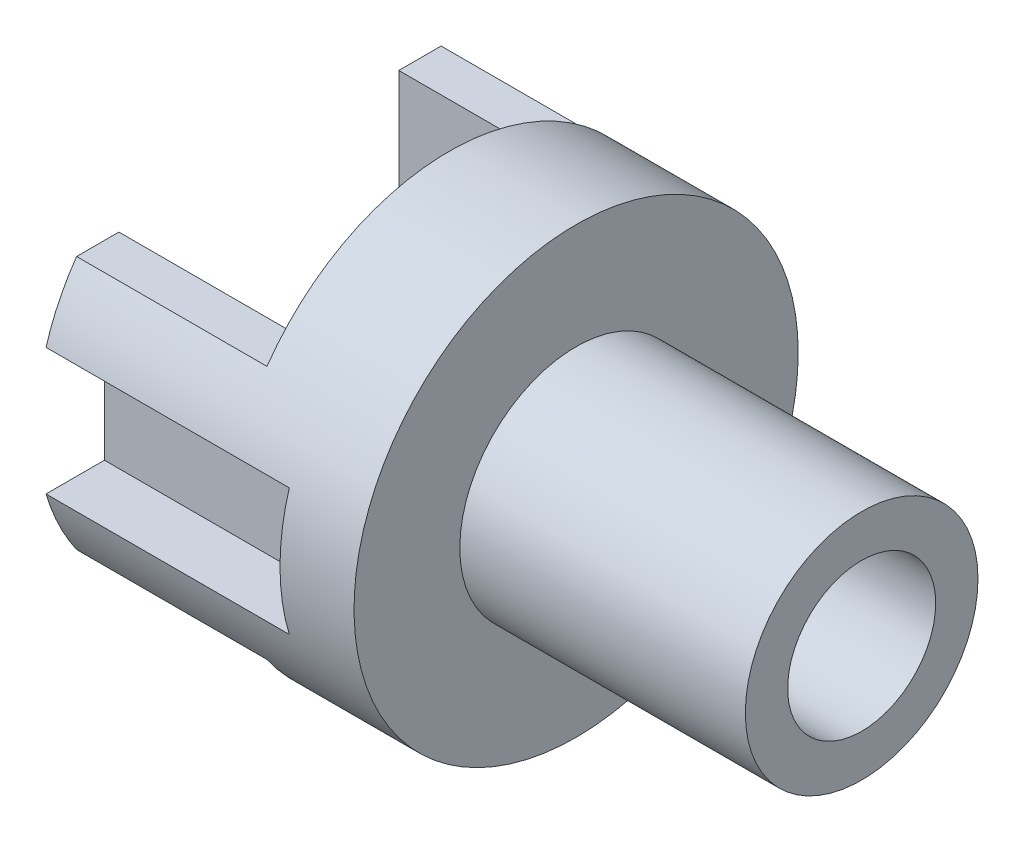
ISO-10303-21;
HEADER;
FILE_DESCRIPTION(('STEP AP214'),'2;1');
FILE_NAME('part.step','',(''),(''),'','','');
FILE_SCHEMA(('AUTOMOTIVE_DESIGN { 1 0 10303 214 1 1 1 1 }'));
ENDSEC;
DATA;
#1=APPLICATION_CONTEXT('core data for automotive mechanical design processes');
#2=APPLICATION_PROTOCOL_DEFINITION('international standard','automotive_design',2000,#1);
#3=PRODUCT_CONTEXT('',#1,'mechanical');
#4=PRODUCT('Part','Part','',(#3));
#5=PRODUCT_RELATED_PRODUCT_CATEGORY('part','',(#4));
#6=PRODUCT_DEFINITION_FORMATION('','',#4);
#7=PRODUCT_DEFINITION_CONTEXT('part definition',#1,'design');
#8=PRODUCT_DEFINITION('design','',#6,#7);
#9=PRODUCT_DEFINITION_SHAPE('','',#8);
#10=(LENGTH_UNIT() NAMED_UNIT(*) SI_UNIT(.MILLI.,.METRE.));
#11=(NAMED_UNIT(*) PLANE_ANGLE_UNIT() SI_UNIT($,.RADIAN.));
#12=(NAMED_UNIT(*) SI_UNIT($,.STERADIAN.) SOLID_ANGLE_UNIT());
#13=UNCERTAINTY_MEASURE_WITH_UNIT(LENGTH_MEASURE(1.E-05),#10,'distance_accuracy_value','');
#14=(GEOMETRIC_REPRESENTATION_CONTEXT(3) GLOBAL_UNCERTAINTY_ASSIGNED_CONTEXT((#13)) GLOBAL_UNIT_ASSIGNED_CONTEXT((#10,
#11,#12)) REPRESENTATION_CONTEXT('',''));
#15=CARTESIAN_POINT('',(0.,0.,0.));
#16=DIRECTION('',(0.,0.,1.));
#17=DIRECTION('',(1.,0.,0.));
#18=AXIS2_PLACEMENT_3D('',#15,#16,#17);
#19=CARTESIAN_POINT('',(120.,0.,0.));
#20=DIRECTION('',(1.,0.,0.));
#21=DIRECTION('',(0.,0.,-1.));
#22=AXIS2_PLACEMENT_3D('',#19,#20,#21);
#23=PLANE('',#22);
#24=CARTESIAN_POINT('',(120.,0.,0.));
#25=DIRECTION('',(1.,0.,0.));
#26=DIRECTION('',(0.,0.,-1.));
#27=AXIS2_PLACEMENT_3D('',#24,#25,#26);
#28=CIRCLE('',#27,84.);
#29=CARTESIAN_POINT('',(120.,0.,-84.));
#30=VERTEX_POINT('',#29);
#31=EDGE_CURVE('E11',#30,#30,#28,.T.);
#32=ORIENTED_EDGE('',*,*,#31,.T.);
#33=EDGE_LOOP('',(#32));
#34=FACE_BOUND('',#33,.T.);
#35=CARTESIAN_POINT('',(120.,0.,0.));
#36=DIRECTION('',(1.,0.,0.));
#37=DIRECTION('',(0.,0.,-1.));
#38=AXIS2_PLACEMENT_3D('',#35,#36,#37);
#39=CIRCLE('',#38,44.);
#40=CARTESIAN_POINT('',(120.,0.,-44.));
#41=VERTEX_POINT('',#40);
#42=EDGE_CURVE('E171',#41,#41,#39,.T.);
#43=ORIENTED_EDGE('',*,*,#42,.F.);
#44=EDGE_LOOP('',(#43));
#45=FACE_BOUND('',#44,.T.);
#46=ADVANCED_FACE('F31',(#34,#45),#23,.T.);
#47=CARTESIAN_POINT('',(120.,0.,0.));
#48=DIRECTION('',(-1.,0.,0.));
#49=DIRECTION('',(0.,0.,1.));
#50=AXIS2_PLACEMENT_3D('',#47,#48,#49);
#51=CYLINDRICAL_SURFACE('',#50,84.);
#52=CARTESIAN_POINT('',(0.,0.,0.));
#53=DIRECTION('',(1.,0.,0.));
#54=DIRECTION('',(0.,0.,-1.));
#55=AXIS2_PLACEMENT_3D('',#52,#53,#54);
#56=CIRCLE('',#55,84.);
#57=CARTESIAN_POINT('',(0.,48.,68.9347517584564));
#58=VERTEX_POINT('',#57);
#59=CARTESIAN_POINT('',(0.,24.,80.4984471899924));
#60=VERTEX_POINT('',#59);
#61=EDGE_CURVE('E40',#58,#60,#56,.T.);
#62=ORIENTED_EDGE('',*,*,#61,.T.);
#63=DIRECTION('',(-1.,0.,0.));
#64=VECTOR('',#63,1.);
#65=CARTESIAN_POINT('',(92.,24.,80.4984471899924));
#66=LINE('',#65,#64);
#67=CARTESIAN_POINT('',(92.,24.,80.4984471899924));
#68=VERTEX_POINT('',#67);
#69=EDGE_CURVE('E181',#68,#60,#66,.T.);
#70=ORIENTED_EDGE('',*,*,#69,.F.);
#71=CARTESIAN_POINT('',(92.,0.,0.));
#72=DIRECTION('',(-1.,0.,0.));
#73=DIRECTION('',(0.,0.,1.));
#74=AXIS2_PLACEMENT_3D('',#71,#72,#73);
#75=CIRCLE('',#74,84.);
#76=CARTESIAN_POINT('',(92.,-24.,80.4984471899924));
#77=VERTEX_POINT('',#76);
#78=EDGE_CURVE('E161',#68,#77,#75,.F.);
#79=ORIENTED_EDGE('',*,*,#78,.T.);
#80=DIRECTION('',(-1.,0.,0.));
#81=VECTOR('',#80,1.);
#82=CARTESIAN_POINT('',(92.,-24.,80.4984471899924));
#83=LINE('',#82,#81);
#84=CARTESIAN_POINT('',(0.,-24.,80.4984471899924));
#85=VERTEX_POINT('',#84);
#86=EDGE_CURVE('E152',#77,#85,#83,.T.);
#87=ORIENTED_EDGE('',*,*,#86,.T.);
#88=CARTESIAN_POINT('',(0.,-48.,68.9347517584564));
#89=VERTEX_POINT('',#88);
#90=EDGE_CURVE('E288',#85,#89,#56,.T.);
#91=ORIENTED_EDGE('',*,*,#90,.T.);
#92=DIRECTION('',(-1.,0.,0.));
#93=VECTOR('',#92,1.);
#94=CARTESIAN_POINT('',(72.,-48.,68.9347517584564));
#95=LINE('',#94,#93);
#96=CARTESIAN_POINT('',(72.,-48.,68.9347517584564));
#97=VERTEX_POINT('',#96);
#98=EDGE_CURVE('E247',#97,#89,#95,.T.);
#99=ORIENTED_EDGE('',*,*,#98,.F.);
#100=CARTESIAN_POINT('',(72.,0.,0.));
#101=DIRECTION('',(-1.,0.,0.));
#102=DIRECTION('',(0.,0.,1.));
#103=AXIS2_PLACEMENT_3D('',#100,#101,#102);
#104=CIRCLE('',#103,84.);
#105=CARTESIAN_POINT('',(72.,-48.,-68.9347517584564));
#106=VERTEX_POINT('',#105);
#107=EDGE_CURVE('E223',#97,#106,#104,.F.);
#108=ORIENTED_EDGE('',*,*,#107,.T.);
#109=DIRECTION('',(-1.,0.,0.));
#110=VECTOR('',#109,1.);
#111=CARTESIAN_POINT('',(72.,-48.,-68.9347517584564));
#112=LINE('',#111,#110);
#113=CARTESIAN_POINT('',(0.,-48.,-68.9347517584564));
#114=VERTEX_POINT('',#113);
#115=EDGE_CURVE('E251',#106,#114,#112,.T.);
#116=ORIENTED_EDGE('',*,*,#115,.T.);
#117=CARTESIAN_POINT('',(0.,-24.,-80.4984471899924));
#118=VERTEX_POINT('',#117);
#119=EDGE_CURVE('E35',#114,#118,#56,.T.);
#120=ORIENTED_EDGE('',*,*,#119,.T.);
#121=DIRECTION('',(-1.,0.,0.));
#122=VECTOR('',#121,1.);
#123=CARTESIAN_POINT('',(92.,-24.,-80.4984471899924));
#124=LINE('',#123,#122);
#125=CARTESIAN_POINT('',(92.,-24.,-80.4984471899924));
#126=VERTEX_POINT('',#125);
#127=EDGE_CURVE('E202',#126,#118,#124,.T.);
#128=ORIENTED_EDGE('',*,*,#127,.F.);
#129=CARTESIAN_POINT('',(92.,0.,0.));
#130=DIRECTION('',(-1.,0.,0.));
#131=DIRECTION('',(0.,0.,1.));
#132=AXIS2_PLACEMENT_3D('',#129,#130,#131);
#133=CIRCLE('',#132,84.);
#134=CARTESIAN_POINT('',(92.,24.,-80.4984471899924));
#135=VERTEX_POINT('',#134);
#136=EDGE_CURVE('E192',#126,#135,#133,.F.);
#137=ORIENTED_EDGE('',*,*,#136,.T.);
#138=DIRECTION('',(-1.,0.,0.));
#139=VECTOR('',#138,1.);
#140=CARTESIAN_POINT('',(92.,24.,-80.4984471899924));
#141=LINE('',#140,#139);
#142=CARTESIAN_POINT('',(0.,24.,-80.4984471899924));
#143=VERTEX_POINT('',#142);
#144=EDGE_CURVE('E205',#135,#143,#141,.T.);
#145=ORIENTED_EDGE('',*,*,#144,.T.);
#146=CARTESIAN_POINT('',(0.,48.,-68.9347517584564));
#147=VERTEX_POINT('',#146);
#148=EDGE_CURVE('E250',#143,#147,#56,.T.);
#149=ORIENTED_EDGE('',*,*,#148,.T.);
#150=DIRECTION('',(-1.,0.,0.));
#151=VECTOR('',#150,1.);
#152=CARTESIAN_POINT('',(72.,48.,-68.9347517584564));
#153=LINE('',#152,#151);
#154=CARTESIAN_POINT('',(72.,48.,-68.9347517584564));
#155=VERTEX_POINT('',#154);
#156=EDGE_CURVE('E258',#155,#147,#153,.T.);
#157=ORIENTED_EDGE('',*,*,#156,.F.);
#158=CARTESIAN_POINT('',(72.,48.,68.9347517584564));
#159=VERTEX_POINT('',#158);
#160=EDGE_CURVE('E219',#155,#159,#104,.F.);
#161=ORIENTED_EDGE('',*,*,#160,.T.);
#162=DIRECTION('',(-1.,0.,0.));
#163=VECTOR('',#162,1.);
#164=CARTESIAN_POINT('',(72.,48.,68.9347517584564));
#165=LINE('',#164,#163);
#166=EDGE_CURVE('E261',#159,#58,#165,.T.);
#167=ORIENTED_EDGE('',*,*,#166,.T.);
#168=EDGE_LOOP('',(#62,#70,#79,#87,#91,#99,#108,#116,#120,#128,#137,#145,#149,#157,#161,#167));
#169=FACE_BOUND('',#168,.T.);
#170=ORIENTED_EDGE('',*,*,#31,.F.);
#171=EDGE_LOOP('',(#170));
#172=FACE_BOUND('',#171,.T.);
#173=ADVANCED_FACE('F33',(#169,#172),#51,.T.);
#174=CARTESIAN_POINT('',(0.,0.,0.));
#175=DIRECTION('',(1.,0.,0.));
#176=DIRECTION('',(0.,0.,-1.));
#177=AXIS2_PLACEMENT_3D('',#174,#175,#176);
#178=PLANE('',#177);
#179=DIRECTION('',(0.,0.,-1.));
#180=VECTOR('',#179,1.);
#181=CARTESIAN_POINT('',(0.,-24.,0.));
#182=LINE('',#181,#180);
#183=CARTESIAN_POINT('',(0.,-24.,-59.8449612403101));
#184=VERTEX_POINT('',#183);
#185=EDGE_CURVE('E55',#184,#118,#182,.T.);
#186=ORIENTED_EDGE('',*,*,#185,.T.);
#187=ORIENTED_EDGE('',*,*,#119,.F.);
#188=DIRECTION('',(0.,0.,-1.));
#189=VECTOR('',#188,1.);
#190=CARTESIAN_POINT('',(0.,-47.9999999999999,0.));
#191=LINE('',#190,#189);
#192=CARTESIAN_POINT('',(0.,-48.,-52.9347517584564));
#193=VERTEX_POINT('',#192);
#194=EDGE_CURVE('E215',#193,#114,#191,.T.);
#195=ORIENTED_EDGE('',*,*,#194,.F.);
#196=DIRECTION('',(0.,-1.,0.));
#197=VECTOR('',#196,1.);
#198=CARTESIAN_POINT('',(0.,-184.941421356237,-52.9347517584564));
#199=LINE('',#198,#197);
#200=CARTESIAN_POINT('',(0.,48.,-52.9347517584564));
#201=VERTEX_POINT('',#200);
#202=EDGE_CURVE('E243',#201,#193,#199,.T.);
#203=ORIENTED_EDGE('',*,*,#202,.F.);
#204=DIRECTION('',(0.,0.,1.));
#205=VECTOR('',#204,1.);
#206=CARTESIAN_POINT('',(0.,48.,0.));
#207=LINE('',#206,#205);
#208=EDGE_CURVE('E240',#147,#201,#207,.T.);
#209=ORIENTED_EDGE('',*,*,#208,.F.);
#210=ORIENTED_EDGE('',*,*,#148,.F.);
#211=DIRECTION('',(0.,0.,1.));
#212=VECTOR('',#211,1.);
#213=CARTESIAN_POINT('',(0.,24.,0.));
#214=LINE('',#213,#212);
#215=CARTESIAN_POINT('',(0.,24.,-59.8449612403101));
#216=VERTEX_POINT('',#215);
#217=EDGE_CURVE('E188',#143,#216,#214,.T.);
#218=ORIENTED_EDGE('',*,*,#217,.T.);
#219=DIRECTION('',(0.,-1.,0.));
#220=VECTOR('',#219,1.);
#221=CARTESIAN_POINT('',(0.,-184.941421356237,-59.8449612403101));
#222=LINE('',#221,#220);
#223=EDGE_CURVE('E197',#216,#184,#222,.T.);
#224=ORIENTED_EDGE('',*,*,#223,.T.);
#225=EDGE_LOOP('',(#186,#187,#195,#203,#209,#210,#218,#224));
#226=FACE_BOUND('',#225,.T.);
#227=ADVANCED_FACE('F302',(#226),#178,.F.);
#228=DIRECTION('',(0.,-1.,0.));
#229=VECTOR('',#228,1.);
#230=CARTESIAN_POINT('',(0.,-184.941421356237,58.4021825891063));
#231=LINE('',#230,#229);
#232=CARTESIAN_POINT('',(0.,24.,58.4021825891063));
#233=VERTEX_POINT('',#232);
#234=CARTESIAN_POINT('',(0.,-24.,58.4021825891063));
#235=VERTEX_POINT('',#234);
#236=EDGE_CURVE('E47',#233,#235,#231,.T.);
#237=ORIENTED_EDGE('',*,*,#236,.F.);
#238=DIRECTION('',(0.,0.,-1.));
#239=VECTOR('',#238,1.);
#240=CARTESIAN_POINT('',(0.,24.,0.));
#241=LINE('',#240,#239);
#242=EDGE_CURVE('E165',#60,#233,#241,.T.);
#243=ORIENTED_EDGE('',*,*,#242,.F.);
#244=ORIENTED_EDGE('',*,*,#61,.F.);
#245=DIRECTION('',(0.,0.,-1.));
#246=VECTOR('',#245,1.);
#247=CARTESIAN_POINT('',(0.,48.0000000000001,3.24203880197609E-13));
#248=LINE('',#247,#246);
#249=CARTESIAN_POINT('',(0.,48.,52.9347517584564));
#250=VERTEX_POINT('',#249);
#251=EDGE_CURVE('E237',#58,#250,#248,.T.);
#252=ORIENTED_EDGE('',*,*,#251,.T.);
#253=DIRECTION('',(0.,-1.,0.));
#254=VECTOR('',#253,1.);
#255=CARTESIAN_POINT('',(0.,-184.941421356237,52.9347517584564));
#256=LINE('',#255,#254);
#257=CARTESIAN_POINT('',(0.,-48.,52.9347517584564));
#258=VERTEX_POINT('',#257);
#259=EDGE_CURVE('E234',#250,#258,#256,.T.);
#260=ORIENTED_EDGE('',*,*,#259,.T.);
#261=DIRECTION('',(0.,0.,1.));
#262=VECTOR('',#261,1.);
#263=CARTESIAN_POINT('',(0.,-48.,0.));
#264=LINE('',#263,#262);
#265=EDGE_CURVE('E204',#258,#89,#264,.T.);
#266=ORIENTED_EDGE('',*,*,#265,.T.);
#267=ORIENTED_EDGE('',*,*,#90,.F.);
#268=DIRECTION('',(0.,0.,1.));
#269=VECTOR('',#268,1.);
#270=CARTESIAN_POINT('',(0.,-24.,0.));
#271=LINE('',#270,#269);
#272=EDGE_CURVE('E168',#235,#85,#271,.T.);
#273=ORIENTED_EDGE('',*,*,#272,.F.);
#274=EDGE_LOOP('',(#237,#243,#244,#252,#260,#266,#267,#273));
#275=FACE_BOUND('',#274,.T.);
#276=ADVANCED_FACE('F287',(#275),#178,.F.);
#277=CARTESIAN_POINT('',(72.,-48.,0.));
#278=DIRECTION('',(0.,-1.,0.));
#279=DIRECTION('',(0.,0.,-1.));
#280=AXIS2_PLACEMENT_3D('',#277,#278,#279);
#281=PLANE('',#280);
#282=ORIENTED_EDGE('',*,*,#265,.F.);
#283=DIRECTION('',(-1.,0.,0.));
#284=VECTOR('',#283,1.);
#285=CARTESIAN_POINT('',(72.,-48.,52.9347517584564));
#286=LINE('',#285,#284);
#287=CARTESIAN_POINT('',(72.,-48.,52.9347517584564));
#288=VERTEX_POINT('',#287);
#289=EDGE_CURVE('E266',#288,#258,#286,.T.);
#290=ORIENTED_EDGE('',*,*,#289,.F.);
#291=DIRECTION('',(0.,0.,1.));
#292=VECTOR('',#291,1.);
#293=CARTESIAN_POINT('',(72.,-48.,0.));
#294=LINE('',#293,#292);
#295=EDGE_CURVE('E211',#288,#97,#294,.T.);
#296=ORIENTED_EDGE('',*,*,#295,.T.);
#297=ORIENTED_EDGE('',*,*,#98,.T.);
#298=EDGE_LOOP('',(#282,#290,#296,#297));
#299=FACE_BOUND('',#298,.T.);
#300=ADVANCED_FACE('F284',(#299),#281,.T.);
#301=CARTESIAN_POINT('',(72.,-47.9999999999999,0.));
#302=DIRECTION('',(0.,1.,0.));
#303=DIRECTION('',(0.,0.,1.));
#304=AXIS2_PLACEMENT_3D('',#301,#302,#303);
#305=PLANE('',#304);
#306=ORIENTED_EDGE('',*,*,#194,.T.);
#307=ORIENTED_EDGE('',*,*,#115,.F.);
#308=DIRECTION('',(0.,0.,-1.));
#309=VECTOR('',#308,1.);
#310=CARTESIAN_POINT('',(72.,-47.9999999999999,0.));
#311=LINE('',#310,#309);
#312=CARTESIAN_POINT('',(72.,-48.,-52.9347517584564));
#313=VERTEX_POINT('',#312);
#314=EDGE_CURVE('E229',#313,#106,#311,.T.);
#315=ORIENTED_EDGE('',*,*,#314,.F.);
#316=DIRECTION('',(-1.,0.,0.));
#317=VECTOR('',#316,1.);
#318=CARTESIAN_POINT('',(72.,-48.,-52.9347517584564));
#319=LINE('',#318,#317);
#320=EDGE_CURVE('E254',#313,#193,#319,.T.);
#321=ORIENTED_EDGE('',*,*,#320,.T.);
#322=EDGE_LOOP('',(#306,#307,#315,#321));
#323=FACE_BOUND('',#322,.T.);
#324=ADVANCED_FACE('F308',(#323),#305,.F.);
#325=CARTESIAN_POINT('',(72.,-184.941421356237,-52.9347517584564));
#326=DIRECTION('',(0.,0.,-1.));
#327=DIRECTION('',(-1.,0.,0.));
#328=AXIS2_PLACEMENT_3D('',#325,#326,#327);
#329=PLANE('',#328);
#330=ORIENTED_EDGE('',*,*,#202,.T.);
#331=ORIENTED_EDGE('',*,*,#320,.F.);
#332=DIRECTION('',(0.,-1.,0.));
#333=VECTOR('',#332,1.);
#334=CARTESIAN_POINT('',(72.,-184.941421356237,-52.9347517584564));
#335=LINE('',#334,#333);
#336=CARTESIAN_POINT('',(72.,48.,-52.9347517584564));
#337=VERTEX_POINT('',#336);
#338=EDGE_CURVE('E226',#337,#313,#335,.T.);
#339=ORIENTED_EDGE('',*,*,#338,.F.);
#340=DIRECTION('',(-1.,0.,0.));
#341=VECTOR('',#340,1.);
#342=CARTESIAN_POINT('',(72.,48.,-52.9347517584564));
#343=LINE('',#342,#341);
#344=EDGE_CURVE('E256',#337,#201,#343,.T.);
#345=ORIENTED_EDGE('',*,*,#344,.T.);
#346=EDGE_LOOP('',(#330,#331,#339,#345));
#347=FACE_BOUND('',#346,.T.);
#348=ADVANCED_FACE('F305',(#347),#329,.F.);
#349=CARTESIAN_POINT('',(72.,48.,0.));
#350=DIRECTION('',(0.,-1.,0.));
#351=DIRECTION('',(0.,0.,-1.));
#352=AXIS2_PLACEMENT_3D('',#349,#350,#351);
#353=PLANE('',#352);
#354=ORIENTED_EDGE('',*,*,#208,.T.);
#355=ORIENTED_EDGE('',*,*,#344,.F.);
#356=DIRECTION('',(0.,0.,1.));
#357=VECTOR('',#356,1.);
#358=CARTESIAN_POINT('',(72.,48.,0.));
#359=LINE('',#358,#357);
#360=EDGE_CURVE('E222',#155,#337,#359,.T.);
#361=ORIENTED_EDGE('',*,*,#360,.F.);
#362=ORIENTED_EDGE('',*,*,#156,.T.);
#363=EDGE_LOOP('',(#354,#355,#361,#362));
#364=FACE_BOUND('',#363,.T.);
#365=ADVANCED_FACE('F299',(#364),#353,.F.);
#366=CARTESIAN_POINT('',(72.,48.0000000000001,3.24203880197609E-13));
#367=DIRECTION('',(0.,1.,0.));
#368=DIRECTION('',(0.,0.,1.));
#369=AXIS2_PLACEMENT_3D('',#366,#367,#368);
#370=PLANE('',#369);
#371=ORIENTED_EDGE('',*,*,#251,.F.);
#372=ORIENTED_EDGE('',*,*,#166,.F.);
#373=DIRECTION('',(0.,0.,-1.));
#374=VECTOR('',#373,1.);
#375=CARTESIAN_POINT('',(72.,48.0000000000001,3.24203880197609E-13));
#376=LINE('',#375,#374);
#377=CARTESIAN_POINT('',(72.,48.,52.9347517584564));
#378=VERTEX_POINT('',#377);
#379=EDGE_CURVE('E217',#159,#378,#376,.T.);
#380=ORIENTED_EDGE('',*,*,#379,.T.);
#381=DIRECTION('',(-1.,0.,0.));
#382=VECTOR('',#381,1.);
#383=CARTESIAN_POINT('',(72.,48.,52.9347517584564));
#384=LINE('',#383,#382);
#385=EDGE_CURVE('E264',#378,#250,#384,.T.);
#386=ORIENTED_EDGE('',*,*,#385,.T.);
#387=EDGE_LOOP('',(#371,#372,#380,#386));
#388=FACE_BOUND('',#387,.T.);
#389=ADVANCED_FACE('F356',(#388),#370,.T.);
#390=CARTESIAN_POINT('',(72.,-184.941421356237,52.9347517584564));
#391=DIRECTION('',(0.,0.,-1.));
#392=DIRECTION('',(-1.,0.,0.));
#393=AXIS2_PLACEMENT_3D('',#390,#391,#392);
#394=PLANE('',#393);
#395=ORIENTED_EDGE('',*,*,#259,.F.);
#396=ORIENTED_EDGE('',*,*,#385,.F.);
#397=DIRECTION('',(0.,-1.,0.));
#398=VECTOR('',#397,1.);
#399=CARTESIAN_POINT('',(72.,-184.941421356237,52.9347517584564));
#400=LINE('',#399,#398);
#401=EDGE_CURVE('E214',#378,#288,#400,.T.);
#402=ORIENTED_EDGE('',*,*,#401,.T.);
#403=ORIENTED_EDGE('',*,*,#289,.T.);
#404=EDGE_LOOP('',(#395,#396,#402,#403));
#405=FACE_BOUND('',#404,.T.);
#406=ADVANCED_FACE('F291',(#405),#394,.T.);
#407=CARTESIAN_POINT('',(72.,-184.941421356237,0.));
#408=DIRECTION('',(-1.,0.,0.));
#409=DIRECTION('',(0.,0.,1.));
#410=AXIS2_PLACEMENT_3D('',#407,#408,#409);
#411=PLANE('',#410);
#412=CARTESIAN_POINT('',(72.,0.,0.));
#413=DIRECTION('',(-1.,0.,0.));
#414=DIRECTION('',(0.,0.,1.));
#415=AXIS2_PLACEMENT_3D('',#412,#413,#414);
#416=CIRCLE('',#415,28.);
#417=CARTESIAN_POINT('',(72.,0.,28.));
#418=VERTEX_POINT('',#417);
#419=EDGE_CURVE('E514',#418,#418,#416,.T.);
#420=ORIENTED_EDGE('',*,*,#419,.F.);
#421=EDGE_LOOP('',(#420));
#422=FACE_BOUND('',#421,.T.);
#423=ORIENTED_EDGE('',*,*,#295,.F.);
#424=ORIENTED_EDGE('',*,*,#401,.F.);
#425=ORIENTED_EDGE('',*,*,#379,.F.);
#426=ORIENTED_EDGE('',*,*,#160,.F.);
#427=ORIENTED_EDGE('',*,*,#360,.T.);
#428=ORIENTED_EDGE('',*,*,#338,.T.);
#429=ORIENTED_EDGE('',*,*,#314,.T.);
#430=ORIENTED_EDGE('',*,*,#107,.F.);
#431=EDGE_LOOP('',(#423,#424,#425,#426,#427,#428,#429,#430));
#432=FACE_BOUND('',#431,.T.);
#433=ADVANCED_FACE('F280',(#422,#432),#411,.T.);
#434=CARTESIAN_POINT('',(92.,-24.,0.));
#435=DIRECTION('',(0.,1.,0.));
#436=DIRECTION('',(0.,0.,1.));
#437=AXIS2_PLACEMENT_3D('',#434,#435,#436);
#438=PLANE('',#437);
#439=ORIENTED_EDGE('',*,*,#185,.F.);
#440=DIRECTION('',(-1.,0.,0.));
#441=VECTOR('',#440,1.);
#442=CARTESIAN_POINT('',(92.,-24.,-59.8449612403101));
#443=LINE('',#442,#441);
#444=CARTESIAN_POINT('',(92.,-24.,-59.8449612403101));
#445=VERTEX_POINT('',#444);
#446=EDGE_CURVE('E195',#445,#184,#443,.T.);
#447=ORIENTED_EDGE('',*,*,#446,.F.);
#448=DIRECTION('',(0.,0.,-1.));
#449=VECTOR('',#448,1.);
#450=CARTESIAN_POINT('',(92.,-24.,0.));
#451=LINE('',#450,#449);
#452=EDGE_CURVE('E184',#445,#126,#451,.T.);
#453=ORIENTED_EDGE('',*,*,#452,.T.);
#454=ORIENTED_EDGE('',*,*,#127,.T.);
#455=EDGE_LOOP('',(#439,#447,#453,#454));
#456=FACE_BOUND('',#455,.T.);
#457=ADVANCED_FACE('F391',(#456),#438,.T.);
#458=CARTESIAN_POINT('',(92.,24.,0.));
#459=DIRECTION('',(0.,-1.,0.));
#460=DIRECTION('',(0.,0.,-1.));
#461=AXIS2_PLACEMENT_3D('',#458,#459,#460);
#462=PLANE('',#461);
#463=ORIENTED_EDGE('',*,*,#217,.F.);
#464=ORIENTED_EDGE('',*,*,#144,.F.);
#465=DIRECTION('',(0.,0.,1.));
#466=VECTOR('',#465,1.);
#467=CARTESIAN_POINT('',(92.,24.,0.));
#468=LINE('',#467,#466);
#469=CARTESIAN_POINT('',(92.,24.,-59.8449612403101));
#470=VERTEX_POINT('',#469);
#471=EDGE_CURVE('E190',#135,#470,#468,.T.);
#472=ORIENTED_EDGE('',*,*,#471,.T.);
#473=DIRECTION('',(-1.,0.,0.));
#474=VECTOR('',#473,1.);
#475=CARTESIAN_POINT('',(92.,24.,-59.8449612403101));
#476=LINE('',#475,#474);
#477=EDGE_CURVE('E208',#470,#216,#476,.T.);
#478=ORIENTED_EDGE('',*,*,#477,.T.);
#479=EDGE_LOOP('',(#463,#464,#472,#478));
#480=FACE_BOUND('',#479,.T.);
#481=ADVANCED_FACE('F441',(#480),#462,.T.);
#482=CARTESIAN_POINT('',(92.,-184.941421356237,-59.8449612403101));
#483=DIRECTION('',(0.,0.,-1.));
#484=DIRECTION('',(-1.,0.,0.));
#485=AXIS2_PLACEMENT_3D('',#482,#483,#484);
#486=PLANE('',#485);
#487=ORIENTED_EDGE('',*,*,#223,.F.);
#488=ORIENTED_EDGE('',*,*,#477,.F.);
#489=DIRECTION('',(0.,-1.,0.));
#490=VECTOR('',#489,1.);
#491=CARTESIAN_POINT('',(92.,-184.941421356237,-59.8449612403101));
#492=LINE('',#491,#490);
#493=EDGE_CURVE('E187',#470,#445,#492,.T.);
#494=ORIENTED_EDGE('',*,*,#493,.T.);
#495=ORIENTED_EDGE('',*,*,#446,.T.);
#496=EDGE_LOOP('',(#487,#488,#494,#495));
#497=FACE_BOUND('',#496,.T.);
#498=ADVANCED_FACE('F439',(#497),#486,.T.);
#499=CARTESIAN_POINT('',(92.,-184.941421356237,0.));
#500=DIRECTION('',(-1.,0.,0.));
#501=DIRECTION('',(0.,0.,1.));
#502=AXIS2_PLACEMENT_3D('',#499,#500,#501);
#503=PLANE('',#502);
#504=ORIENTED_EDGE('',*,*,#452,.F.);
#505=ORIENTED_EDGE('',*,*,#493,.F.);
#506=ORIENTED_EDGE('',*,*,#471,.F.);
#507=ORIENTED_EDGE('',*,*,#136,.F.);
#508=EDGE_LOOP('',(#504,#505,#506,#507));
#509=FACE_BOUND('',#508,.T.);
#510=ADVANCED_FACE('F436',(#509),#503,.T.);
#511=CARTESIAN_POINT('',(92.,-184.941421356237,58.4021825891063));
#512=DIRECTION('',(0.,0.,-1.));
#513=DIRECTION('',(-1.,0.,0.));
#514=AXIS2_PLACEMENT_3D('',#511,#512,#513);
#515=PLANE('',#514);
#516=ORIENTED_EDGE('',*,*,#236,.T.);
#517=DIRECTION('',(-1.,0.,0.));
#518=VECTOR('',#517,1.);
#519=CARTESIAN_POINT('',(92.,-24.,58.4021825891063));
#520=LINE('',#519,#518);
#521=CARTESIAN_POINT('',(92.,-24.,58.4021825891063));
#522=VERTEX_POINT('',#521);
#523=EDGE_CURVE('E144',#522,#235,#520,.T.);
#524=ORIENTED_EDGE('',*,*,#523,.F.);
#525=DIRECTION('',(0.,-1.,0.));
#526=VECTOR('',#525,1.);
#527=CARTESIAN_POINT('',(92.,-184.941421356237,58.4021825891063));
#528=LINE('',#527,#526);
#529=CARTESIAN_POINT('',(92.,24.,58.4021825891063));
#530=VERTEX_POINT('',#529);
#531=EDGE_CURVE('E148',#530,#522,#528,.T.);
#532=ORIENTED_EDGE('',*,*,#531,.F.);
#533=DIRECTION('',(-1.,0.,0.));
#534=VECTOR('',#533,1.);
#535=CARTESIAN_POINT('',(92.,24.,58.4021825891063));
#536=LINE('',#535,#534);
#537=EDGE_CURVE('E179',#530,#233,#536,.T.);
#538=ORIENTED_EDGE('',*,*,#537,.T.);
#539=EDGE_LOOP('',(#516,#524,#532,#538));
#540=FACE_BOUND('',#539,.T.);
#541=ADVANCED_FACE('F146',(#540),#515,.F.);
#542=CARTESIAN_POINT('',(92.,24.,0.));
#543=DIRECTION('',(0.,1.,0.));
#544=DIRECTION('',(0.,0.,1.));
#545=AXIS2_PLACEMENT_3D('',#542,#543,#544);
#546=PLANE('',#545);
#547=ORIENTED_EDGE('',*,*,#242,.T.);
#548=ORIENTED_EDGE('',*,*,#537,.F.);
#549=DIRECTION('',(0.,0.,-1.));
#550=VECTOR('',#549,1.);
#551=CARTESIAN_POINT('',(92.,24.,0.));
#552=LINE('',#551,#550);
#553=EDGE_CURVE('E153',#68,#530,#552,.T.);
#554=ORIENTED_EDGE('',*,*,#553,.F.);
#555=ORIENTED_EDGE('',*,*,#69,.T.);
#556=EDGE_LOOP('',(#547,#548,#554,#555));
#557=FACE_BOUND('',#556,.T.);
#558=ADVANCED_FACE('F428',(#557),#546,.F.);
#559=CARTESIAN_POINT('',(92.,-24.,0.));
#560=DIRECTION('',(0.,-1.,0.));
#561=DIRECTION('',(0.,0.,-1.));
#562=AXIS2_PLACEMENT_3D('',#559,#560,#561);
#563=PLANE('',#562);
#564=ORIENTED_EDGE('',*,*,#272,.T.);
#565=ORIENTED_EDGE('',*,*,#86,.F.);
#566=DIRECTION('',(0.,0.,1.));
#567=VECTOR('',#566,1.);
#568=CARTESIAN_POINT('',(92.,-24.,0.));
#569=LINE('',#568,#567);
#570=EDGE_CURVE('E156',#522,#77,#569,.T.);
#571=ORIENTED_EDGE('',*,*,#570,.F.);
#572=ORIENTED_EDGE('',*,*,#523,.T.);
#573=EDGE_LOOP('',(#564,#565,#571,#572));
#574=FACE_BOUND('',#573,.T.);
#575=ADVANCED_FACE('F157',(#574),#563,.F.);
#576=CARTESIAN_POINT('',(92.,-184.941421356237,0.));
#577=DIRECTION('',(-1.,0.,0.));
#578=DIRECTION('',(0.,0.,1.));
#579=AXIS2_PLACEMENT_3D('',#576,#577,#578);
#580=PLANE('',#579);
#581=ORIENTED_EDGE('',*,*,#531,.T.);
#582=ORIENTED_EDGE('',*,*,#570,.T.);
#583=ORIENTED_EDGE('',*,*,#78,.F.);
#584=ORIENTED_EDGE('',*,*,#553,.T.);
#585=EDGE_LOOP('',(#581,#582,#583,#584));
#586=FACE_BOUND('',#585,.T.);
#587=ADVANCED_FACE('F163',(#586),#580,.T.);
#588=CARTESIAN_POINT('',(228.,0.,0.));
#589=DIRECTION('',(-1.,0.,0.));
#590=DIRECTION('',(0.,0.,1.));
#591=AXIS2_PLACEMENT_3D('',#588,#589,#590);
#592=CYLINDRICAL_SURFACE('',#591,44.);
#593=CARTESIAN_POINT('',(228.,0.,0.));
#594=DIRECTION('',(1.,0.,0.));
#595=DIRECTION('',(0.,0.,-1.));
#596=AXIS2_PLACEMENT_3D('',#593,#594,#595);
#597=CIRCLE('',#596,44.);
#598=CARTESIAN_POINT('',(228.,0.,-44.));
#599=VERTEX_POINT('',#598);
#600=EDGE_CURVE('E177',#599,#599,#597,.T.);
#601=ORIENTED_EDGE('',*,*,#600,.F.);
#602=EDGE_LOOP('',(#601));
#603=FACE_BOUND('',#602,.T.);
#604=ORIENTED_EDGE('',*,*,#42,.T.);
#605=EDGE_LOOP('',(#604));
#606=FACE_BOUND('',#605,.T.);
#607=ADVANCED_FACE('F398',(#603,#606),#592,.T.);
#608=CARTESIAN_POINT('',(228.,0.,0.));
#609=DIRECTION('',(1.,0.,0.));
#610=DIRECTION('',(0.,0.,-1.));
#611=AXIS2_PLACEMENT_3D('',#608,#609,#610);
#612=PLANE('',#611);
#613=CARTESIAN_POINT('',(228.,0.,0.));
#614=DIRECTION('',(1.,0.,0.));
#615=DIRECTION('',(0.,0.,-1.));
#616=AXIS2_PLACEMENT_3D('',#613,#614,#615);
#617=CIRCLE('',#616,28.);
#618=CARTESIAN_POINT('',(228.,0.,-28.));
#619=VERTEX_POINT('',#618);
#620=EDGE_CURVE('E515',#619,#619,#617,.T.);
#621=ORIENTED_EDGE('',*,*,#620,.F.);
#622=EDGE_LOOP('',(#621));
#623=FACE_BOUND('',#622,.T.);
#624=ORIENTED_EDGE('',*,*,#600,.T.);
#625=EDGE_LOOP('',(#624));
#626=FACE_BOUND('',#625,.T.);
#627=ADVANCED_FACE('F402',(#623,#626),#612,.T.);
#628=CARTESIAN_POINT('',(0.,0.,0.));
#629=DIRECTION('',(1.,0.,0.));
#630=DIRECTION('',(0.,0.,-1.));
#631=AXIS2_PLACEMENT_3D('',#628,#629,#630);
#632=CYLINDRICAL_SURFACE('',#631,28.);
#633=ORIENTED_EDGE('',*,*,#419,.T.);
#634=EDGE_LOOP('',(#633));
#635=FACE_BOUND('',#634,.T.);
#636=ORIENTED_EDGE('',*,*,#620,.T.);
#637=EDGE_LOOP('',(#636));
#638=FACE_BOUND('',#637,.T.);
#639=ADVANCED_FACE('F407',(#635,#638),#632,.F.);
#640=CLOSED_SHELL('',(#46,#173,#227,#276,#300,#324,#348,#365,#389,#406,#433,#457,#481,#498,#510,
#541,#558,#575,#587,#607,#627,#639));
#641=MANIFOLD_SOLID_BREP('B2',#640);
#642=ADVANCED_BREP_SHAPE_REPRESENTATION('',(#18,#641),#14);
#643=SHAPE_DEFINITION_REPRESENTATION(#9,#642);
ENDSEC;
END-ISO-10303-21;
